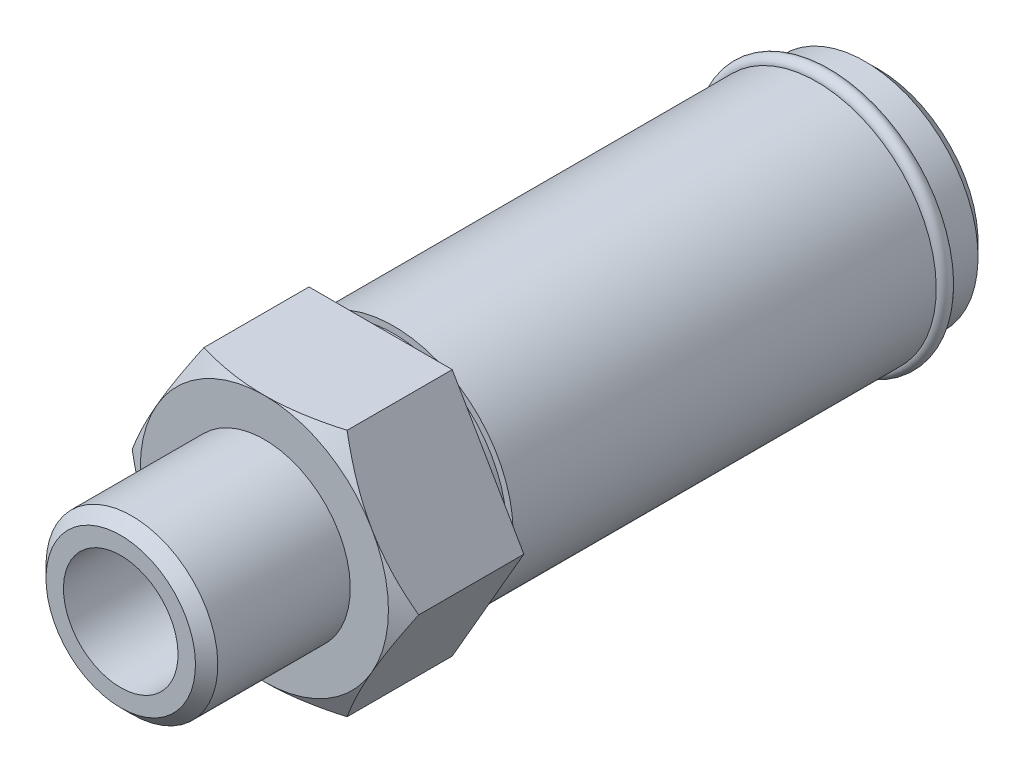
from build123d import *

# Parameters (mm, degrees)
CUT_EXTRUDE_START   = -8.9
SKETCH_2_R          = 19
CUT_EXTRUDE_1_DEPTH = 8.9


with BuildPart() as part:
    # Sketch 1 → Revolve 1 (revolve)
    with BuildSketch(Plane(origin=(0, 0, 0), x_dir=(0, 0, -1), z_dir=(1, 0, 0)), mode=Mode.PRIVATE) as revolve_1_sk:
        with BuildLine():
            Line((-34.4, 0), (-34.4, 4.385666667))
            Line((-34.4, 4.385666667), (-54.4, 4.385666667))
            Line((-54.4, 4.385666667), (-54.4, 5.7225))
            Line((-54.4, 5.7225), (-53.544, 6.5785))
            Line((-53.544, 6.5785), (-43.4, 6.5785))
            Line((-43.4, 6.5785), (-43.4, 9.5))
            Line((-43.4, 9.5), (-37.915172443, 19))
            Line((-37.915172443, 19), (-34.5, 19))
            Line((-34.5, 19), (-34.5, 8.65))
            Line((-34.5, 8.65), (-33.5, 8.65))
            Line((-33.5, 8.65), (-33.5, 9.15))
            Line((-33.5, 9.15), (-1.1, 9.15))
            ThreePointArc((-1.1, 9.15), (-0.55, 9.7), (0, 9.15))
            Line((0, 9.15), (0, 8.65))
            Line((0, 8.65), (2.6, 8.65))
            Line((2.6, 8.65), (3.6, 7.65))
            Line((3.6, 7.65), (3.6, 6.5785))
            Line((3.6, 6.5785), (2.744, 5.7225))
            Line((2.744, 5.7225), (-7.4, 5.7225))
            Line((-7.4, 5.7225), (-7.4, 0))
            Line((-7.4, 0), (-34.4, 0))
        make_face()
    revolve(revolve_1_sk.sketch.rotate(Axis((0, 0, -3.6), (0, 0, 1)), 180), axis=Axis((0, 0, -3.6), (0, 0, 1)))

    # Sketch 2 → Cut-Extrude 1 (cut)
    with BuildSketch(Plane.XY.offset(43.4).offset(CUT_EXTRUDE_START)):
        Circle(SKETCH_2_R)
        Polygon((5.484827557, -9.5), (10.969655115, 0), (5.484827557, 9.5), (-5.484827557, 9.5), (-10.969655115, 0), (-5.484827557, -9.5), align=None, mode=Mode.SUBTRACT)
    extrude(amount=CUT_EXTRUDE_1_DEPTH, mode=Mode.SUBTRACT)


solid = part.part
